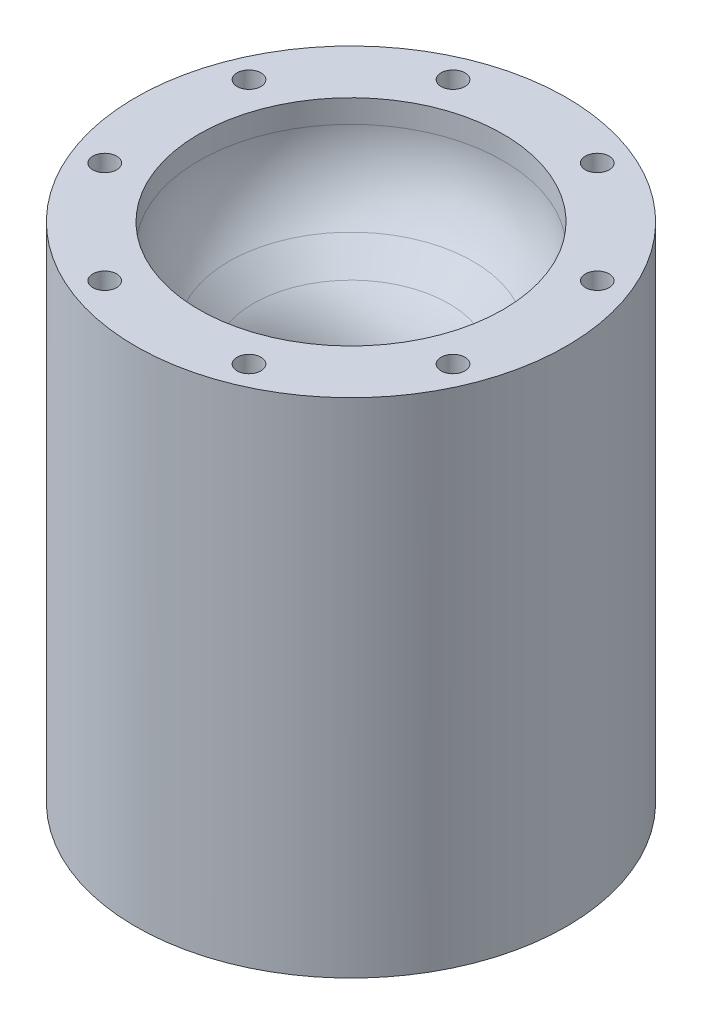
ISO-10303-21;
HEADER;
FILE_DESCRIPTION(('STEP AP214'),'2;1');
FILE_NAME('part.step','',(''),(''),'','','');
FILE_SCHEMA(('AUTOMOTIVE_DESIGN { 1 0 10303 214 1 1 1 1 }'));
ENDSEC;
DATA;
#1=APPLICATION_CONTEXT('core data for automotive mechanical design processes');
#2=APPLICATION_PROTOCOL_DEFINITION('international standard','automotive_design',2000,#1);
#3=PRODUCT_CONTEXT('',#1,'mechanical');
#4=PRODUCT('Part','Part','',(#3));
#5=PRODUCT_RELATED_PRODUCT_CATEGORY('part','',(#4));
#6=PRODUCT_DEFINITION_FORMATION('','',#4);
#7=PRODUCT_DEFINITION_CONTEXT('part definition',#1,'design');
#8=PRODUCT_DEFINITION('design','',#6,#7);
#9=PRODUCT_DEFINITION_SHAPE('','',#8);
#10=(LENGTH_UNIT() NAMED_UNIT(*) SI_UNIT(.MILLI.,.METRE.));
#11=(NAMED_UNIT(*) PLANE_ANGLE_UNIT() SI_UNIT($,.RADIAN.));
#12=(NAMED_UNIT(*) SI_UNIT($,.STERADIAN.) SOLID_ANGLE_UNIT());
#13=UNCERTAINTY_MEASURE_WITH_UNIT(LENGTH_MEASURE(1.E-05),#10,'distance_accuracy_value','');
#14=(GEOMETRIC_REPRESENTATION_CONTEXT(3) GLOBAL_UNCERTAINTY_ASSIGNED_CONTEXT((#13)) GLOBAL_UNIT_ASSIGNED_CONTEXT((#10,
#11,#12)) REPRESENTATION_CONTEXT('',''));
#15=CARTESIAN_POINT('',(0.,0.,0.));
#16=DIRECTION('',(0.,0.,1.));
#17=DIRECTION('',(1.,0.,0.));
#18=AXIS2_PLACEMENT_3D('',#15,#16,#17);
#19=CARTESIAN_POINT('',(-105.474898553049,0.,22.1235140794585));
#20=DIRECTION('',(0.,1.,0.));
#21=DIRECTION('',(-0.546944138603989,0.,0.837169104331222));
#22=AXIS2_PLACEMENT_3D('',#19,#20,#21);
#23=PLANE('',#22);
#24=CARTESIAN_POINT('',(25.5154178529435,0.,61.5996678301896));
#25=DIRECTION('',(0.,1.,0.));
#26=DIRECTION('',(0.,0.,1.));
#27=AXIS2_PLACEMENT_3D('',#24,#25,#26);
#28=CIRCLE('',#27,4.21639999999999);
#29=CARTESIAN_POINT('',(25.5154178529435,0.,65.8160678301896));
#30=VERTEX_POINT('',#29);
#31=EDGE_CURVE('E84',#30,#30,#28,.T.);
#32=ORIENTED_EDGE('',*,*,#31,.F.);
#33=EDGE_LOOP('',(#32));
#34=FACE_BOUND('',#33,.T.);
#35=CARTESIAN_POINT('',(-25.5154178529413,0.,61.5996678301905));
#36=DIRECTION('',(0.,1.,0.));
#37=DIRECTION('',(0.,0.,1.));
#38=AXIS2_PLACEMENT_3D('',#35,#36,#37);
#39=CIRCLE('',#38,4.21639999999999);
#40=CARTESIAN_POINT('',(-25.5154178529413,0.,65.8160678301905));
#41=VERTEX_POINT('',#40);
#42=EDGE_CURVE('E83',#41,#41,#39,.T.);
#43=ORIENTED_EDGE('',*,*,#42,.F.);
#44=EDGE_LOOP('',(#43));
#45=FACE_BOUND('',#44,.T.);
#46=CARTESIAN_POINT('',(-61.5996678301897,0.,25.5154178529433));
#47=DIRECTION('',(0.,1.,0.));
#48=DIRECTION('',(0.,0.,1.));
#49=AXIS2_PLACEMENT_3D('',#46,#47,#48);
#50=CIRCLE('',#49,4.21639999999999);
#51=CARTESIAN_POINT('',(-61.5996678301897,0.,29.7318178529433));
#52=VERTEX_POINT('',#51);
#53=EDGE_CURVE('E94',#52,#52,#50,.T.);
#54=ORIENTED_EDGE('',*,*,#53,.F.);
#55=EDGE_LOOP('',(#54));
#56=FACE_BOUND('',#55,.T.);
#57=CARTESIAN_POINT('',(-61.5996678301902,0.,-25.515417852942));
#58=DIRECTION('',(0.,1.,0.));
#59=DIRECTION('',(0.,0.,1.));
#60=AXIS2_PLACEMENT_3D('',#57,#58,#59);
#61=CIRCLE('',#60,4.21639999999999);
#62=CARTESIAN_POINT('',(-61.5996678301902,0.,-21.299017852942));
#63=VERTEX_POINT('',#62);
#64=EDGE_CURVE('E100',#63,#63,#61,.T.);
#65=ORIENTED_EDGE('',*,*,#64,.F.);
#66=EDGE_LOOP('',(#65));
#67=FACE_BOUND('',#66,.T.);
#68=CARTESIAN_POINT('',(-25.5154178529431,0.,-61.5996678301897));
#69=DIRECTION('',(0.,1.,0.));
#70=DIRECTION('',(0.,0.,1.));
#71=AXIS2_PLACEMENT_3D('',#68,#69,#70);
#72=CIRCLE('',#71,4.21639999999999);
#73=CARTESIAN_POINT('',(-25.5154178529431,0.,-57.3832678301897));
#74=VERTEX_POINT('',#73);
#75=EDGE_CURVE('E106',#74,#74,#72,.T.);
#76=ORIENTED_EDGE('',*,*,#75,.F.);
#77=EDGE_LOOP('',(#76));
#78=FACE_BOUND('',#77,.T.);
#79=CARTESIAN_POINT('',(25.5154178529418,0.,-61.5996678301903));
#80=DIRECTION('',(0.,1.,0.));
#81=DIRECTION('',(0.,0.,1.));
#82=AXIS2_PLACEMENT_3D('',#79,#80,#81);
#83=CIRCLE('',#82,4.21639999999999);
#84=CARTESIAN_POINT('',(25.5154178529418,0.,-57.3832678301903));
#85=VERTEX_POINT('',#84);
#86=EDGE_CURVE('E112',#85,#85,#83,.T.);
#87=ORIENTED_EDGE('',*,*,#86,.F.);
#88=EDGE_LOOP('',(#87));
#89=FACE_BOUND('',#88,.T.);
#90=CARTESIAN_POINT('',(61.5996678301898,0.,-25.5154178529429));
#91=DIRECTION('',(0.,1.,0.));
#92=DIRECTION('',(0.,0.,1.));
#93=AXIS2_PLACEMENT_3D('',#90,#91,#92);
#94=CIRCLE('',#93,4.21639999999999);
#95=CARTESIAN_POINT('',(61.5996678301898,0.,-21.2990178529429));
#96=VERTEX_POINT('',#95);
#97=EDGE_CURVE('E118',#96,#96,#94,.T.);
#98=ORIENTED_EDGE('',*,*,#97,.F.);
#99=EDGE_LOOP('',(#98));
#100=FACE_BOUND('',#99,.T.);
#101=CARTESIAN_POINT('',(61.5996678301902,0.,25.515417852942));
#102=DIRECTION('',(0.,1.,0.));
#103=DIRECTION('',(0.,0.,1.));
#104=AXIS2_PLACEMENT_3D('',#101,#102,#103);
#105=CIRCLE('',#104,4.21639999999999);
#106=CARTESIAN_POINT('',(61.5996678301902,0.,29.731817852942));
#107=VERTEX_POINT('',#106);
#108=EDGE_CURVE('E124',#107,#107,#105,.T.);
#109=ORIENTED_EDGE('',*,*,#108,.F.);
#110=EDGE_LOOP('',(#109));
#111=FACE_BOUND('',#110,.T.);
#112=CARTESIAN_POINT('',(0.,0.,0.));
#113=DIRECTION('',(0.,1.,0.));
#114=DIRECTION('',(-0.546944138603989,0.,0.837169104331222));
#115=AXIS2_PLACEMENT_3D('',#112,#113,#114);
#116=CIRCLE('',#115,53.7924602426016);
#117=CARTESIAN_POINT('',(-29.421470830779,0.,45.0333857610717));
#118=VERTEX_POINT('',#117);
#119=EDGE_CURVE('E134',#118,#118,#116,.F.);
#120=ORIENTED_EDGE('',*,*,#119,.T.);
#121=EDGE_LOOP('',(#120));
#122=FACE_BOUND('',#121,.T.);
#123=CARTESIAN_POINT('',(0.,0.,0.));
#124=DIRECTION('',(0.,1.,0.));
#125=DIRECTION('',(-0.546944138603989,0.,0.837169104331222));
#126=AXIS2_PLACEMENT_3D('',#123,#124,#125);
#127=CIRCLE('',#126,76.2);
#128=CARTESIAN_POINT('',(-41.6771433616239,0.,63.7922857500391));
#129=VERTEX_POINT('',#128);
#130=EDGE_CURVE('E42',#129,#129,#127,.T.);
#131=ORIENTED_EDGE('',*,*,#130,.T.);
#132=EDGE_LOOP('',(#131));
#133=FACE_BOUND('',#132,.T.);
#134=ADVANCED_FACE('F38',(#34,#45,#56,#67,#78,#89,#100,#111,#122,#133),#23,.T.);
#135=CARTESIAN_POINT('',(0.,-67.8726529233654,0.));
#136=DIRECTION('',(0.,-1.,0.));
#137=DIRECTION('',(0.546944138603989,0.,-0.837169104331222));
#138=AXIS2_PLACEMENT_3D('',#135,#136,#137);
#139=CYLINDRICAL_SURFACE('',#138,53.7924602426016);
#140=CARTESIAN_POINT('',(0.,-8.14497921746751,0.));
#141=DIRECTION('',(0.,-1.,0.));
#142=DIRECTION('',(0.546944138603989,0.,-0.837169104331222));
#143=AXIS2_PLACEMENT_3D('',#140,#141,#142);
#144=CIRCLE('',#143,53.7924602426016);
#145=CARTESIAN_POINT('',(29.421470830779,-8.14497921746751,-45.0333857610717));
#146=VERTEX_POINT('',#145);
#147=EDGE_CURVE('E140',#146,#146,#144,.T.);
#148=ORIENTED_EDGE('',*,*,#147,.T.);
#149=EDGE_LOOP('',(#148));
#150=FACE_BOUND('',#149,.T.);
#151=ORIENTED_EDGE('',*,*,#119,.F.);
#152=EDGE_LOOP('',(#151));
#153=FACE_BOUND('',#152,.T.);
#154=ADVANCED_FACE('F40',(#150,#153),#139,.F.);
#155=CARTESIAN_POINT('',(0.,-67.8726529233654,0.));
#156=DIRECTION('',(0.,-1.,0.));
#157=DIRECTION('',(0.546944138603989,0.,-0.837169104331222));
#158=AXIS2_PLACEMENT_3D('',#155,#156,#157);
#159=CYLINDRICAL_SURFACE('',#158,76.2);
#160=CARTESIAN_POINT('',(0.,-177.8,0.));
#161=DIRECTION('',(0.,-1.,0.));
#162=DIRECTION('',(0.546944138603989,0.,-0.837169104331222));
#163=AXIS2_PLACEMENT_3D('',#160,#161,#162);
#164=CIRCLE('',#163,76.2);
#165=CARTESIAN_POINT('',(41.6771433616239,-177.8,-63.7922857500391));
#166=VERTEX_POINT('',#165);
#167=EDGE_CURVE('E143',#166,#166,#164,.T.);
#168=ORIENTED_EDGE('',*,*,#167,.F.);
#169=EDGE_LOOP('',(#168));
#170=FACE_BOUND('',#169,.T.);
#171=ORIENTED_EDGE('',*,*,#130,.F.);
#172=EDGE_LOOP('',(#171));
#173=FACE_BOUND('',#172,.T.);
#174=ADVANCED_FACE('F170',(#170,#173),#159,.T.);
#175=CARTESIAN_POINT('',(22.3576150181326,-74.3818925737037,14.6068057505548));
#176=CARTESIAN_POINT('',(22.3151212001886,-74.3311317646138,14.5790434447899));
#177=CARTESIAN_POINT('',(22.2531052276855,-74.2547747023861,14.5385268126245));
#178=CARTESIAN_POINT('',(22.1142299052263,-74.081294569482,14.4477959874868));
#179=CARTESIAN_POINT('',(21.9985251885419,-73.9226045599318,14.372203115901));
#180=CARTESIAN_POINT('',(21.8415816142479,-73.7055665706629,14.2696678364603));
#181=CARTESIAN_POINT('',(21.6955199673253,-73.4833804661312,14.1742420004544));
#182=CARTESIAN_POINT('',(21.5175234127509,-73.198171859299,14.0579522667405));
#183=CARTESIAN_POINT('',(21.3590694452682,-72.9183567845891,13.9544302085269));
#184=CARTESIAN_POINT('',(21.2033340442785,-72.6239544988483,13.8526842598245));
#185=CARTESIAN_POINT('',(21.0606165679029,-72.327436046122,13.7594432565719));
#186=CARTESIAN_POINT('',(20.9250437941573,-72.0219351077,13.6708700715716));
#187=CARTESIAN_POINT('',(20.8004861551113,-71.7123196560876,13.5894933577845));
#188=CARTESIAN_POINT('',(20.6848821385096,-71.3962800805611,13.5139662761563));
#189=CARTESIAN_POINT('',(20.5797523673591,-71.0759999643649,13.4452822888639));
#190=CARTESIAN_POINT('',(20.484417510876,-70.7507455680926,13.3829975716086));
#191=CARTESIAN_POINT('',(20.3995136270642,-70.4218923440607,13.3275276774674));
#192=CARTESIAN_POINT('',(20.3248532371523,-70.0890073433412,13.2787501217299));
#193=CARTESIAN_POINT('',(20.2607278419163,-69.7536497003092,13.2368553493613));
#194=CARTESIAN_POINT('',(20.2071118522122,-69.414703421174,13.2018266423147));
#195=CARTESIAN_POINT('',(20.1641528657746,-69.075190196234,13.1737604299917));
#196=CARTESIAN_POINT('',(20.1358987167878,-68.7740862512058,13.1553012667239));
#197=CARTESIAN_POINT('',(20.1184006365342,-68.519417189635,13.1438693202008));
#198=CARTESIAN_POINT('',(20.1082943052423,-68.2997170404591,13.1372665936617));
#199=CARTESIAN_POINT('',(20.10290474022,-68.1402939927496,13.133745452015));
#200=CARTESIAN_POINT('',(20.1008809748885,-67.9827666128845,13.1324232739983));
#201=CARTESIAN_POINT('',(20.1004307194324,-67.9085455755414,13.1321291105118));
#202=CARTESIAN_POINT('',(20.1004301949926,-67.8726529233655,13.1321287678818));
#203=B_SPLINE_CURVE_WITH_KNOTS('',4,(#175,#176,#177,#178,#179,#180,#181,#182,#183,#184,#185,
#186,#187,#188,#189,#190,#191,#192,#193,#194,#195,#196,#197,#198,#199,#200,#201,#202),
.UNSPECIFIED.,.F.,.F.,(5,1,1,1,1,1,1,1,1,1,1,1,1,1,1,1,1,1,1,1,1,1,1,1,5),(0.0825688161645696,
0.122284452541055,0.142142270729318,0.162000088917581,0.201715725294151,0.241431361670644,
0.281146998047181,0.320862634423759,0.360578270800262,0.400293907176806,0.440009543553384,
0.479725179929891,0.519440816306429,0.55915645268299,0.598872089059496,0.638587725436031,
0.678303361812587,0.718018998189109,0.75773463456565,0.797450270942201,0.837165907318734,
0.857023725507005,0.876881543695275,0.896739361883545,0.916597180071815),.UNSPECIFIED.);
#204=CARTESIAN_POINT('',(0.,-67.8726529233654,0.));
#205=DIRECTION('',(0.,-1.,0.));
#206=AXIS1_PLACEMENT('',#204,#205);
#207=SURFACE_OF_REVOLUTION('',#203,#206);
#208=CARTESIAN_POINT('',(0.,-67.8726529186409,0.));
#209=DIRECTION('',(0.,-1.,0.));
#210=DIRECTION('',(0.546944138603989,0.,-0.837169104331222));
#211=AXIS2_PLACEMENT_3D('',#208,#209,#210);
#212=CIRCLE('',#211,24.0100000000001);
#213=CARTESIAN_POINT('',(13.1321287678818,-67.8726529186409,-20.1004301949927));
#214=VERTEX_POINT('',#213);
#215=EDGE_CURVE('E130',#214,#214,#212,.T.);
#216=ORIENTED_EDGE('',*,*,#215,.F.);
#217=EDGE_LOOP('',(#216));
#218=FACE_BOUND('',#217,.T.);
#219=CARTESIAN_POINT('',(0.,-74.3818925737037,0.));
#220=DIRECTION('',(0.,-1.,0.));
#221=DIRECTION('',(0.546944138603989,0.,-0.837169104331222));
#222=AXIS2_PLACEMENT_3D('',#219,#220,#221);
#223=CIRCLE('',#222,26.7062113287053);
#224=CARTESIAN_POINT('',(14.6068057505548,-74.3818925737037,-22.3576150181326));
#225=VERTEX_POINT('',#224);
#226=EDGE_CURVE('E11',#225,#225,#223,.T.);
#227=ORIENTED_EDGE('',*,*,#226,.T.);
#228=EDGE_LOOP('',(#227));
#229=FACE_BOUND('',#228,.T.);
#230=ADVANCED_FACE('F172',(#218,#229),#207,.T.);
#231=CARTESIAN_POINT('',(20.1004301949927,-67.8726529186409,13.1321287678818));
#232=CARTESIAN_POINT('',(20.1004312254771,-67.8021242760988,13.1321294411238));
#233=CARTESIAN_POINT('',(20.1008742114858,-67.6590687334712,13.1324188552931));
#234=CARTESIAN_POINT('',(20.1028630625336,-67.3294700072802,13.133718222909));
#235=CARTESIAN_POINT('',(20.1081576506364,-67.0484925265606,13.1371773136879));
#236=CARTESIAN_POINT('',(20.1160983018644,-66.6778308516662,13.1423651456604));
#237=CARTESIAN_POINT('',(20.1266820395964,-66.3592178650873,13.1492797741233));
#238=CARTESIAN_POINT('',(20.1399094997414,-66.0107133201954,13.1579216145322));
#239=CARTESIAN_POINT('',(20.1557782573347,-65.6789460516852,13.1682890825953));
#240=CARTESIAN_POINT('',(20.178915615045,-65.254583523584,13.1834053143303));
#241=CARTESIAN_POINT('',(20.2119571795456,-64.750618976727,13.2049922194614));
#242=CARTESIAN_POINT('',(20.2714067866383,-63.9926742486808,13.243832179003));
#243=CARTESIAN_POINT('',(20.3717222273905,-62.9862025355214,13.3093708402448));
#244=CARTESIAN_POINT('',(20.5193648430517,-61.8159421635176,13.4058295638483));
#245=CARTESIAN_POINT('',(20.7298284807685,-60.4874865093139,13.5433308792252));
#246=CARTESIAN_POINT('',(20.9817411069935,-59.1690784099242,13.7079118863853));
#247=CARTESIAN_POINT('',(21.2747296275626,-57.8630157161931,13.8993288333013));
#248=CARTESIAN_POINT('',(21.6084171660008,-56.5708333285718,14.1173354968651));
#249=CARTESIAN_POINT('',(21.9822838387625,-55.2945535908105,14.3615922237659));
#250=CARTESIAN_POINT('',(22.3958938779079,-54.0357654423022,14.6318143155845));
#251=CARTESIAN_POINT('',(22.8485259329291,-52.7964557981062,14.9275304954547));
#252=CARTESIAN_POINT('',(23.3397820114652,-51.5780431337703,15.2484807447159));
#253=CARTESIAN_POINT('',(23.8685882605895,-50.3827141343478,15.5939634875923));
#254=CARTESIAN_POINT('',(24.4348435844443,-49.2113651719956,15.963912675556));
#255=CARTESIAN_POINT('',(25.0366950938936,-48.0669095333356,16.3571177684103));
#256=CARTESIAN_POINT('',(25.675100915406,-46.9487928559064,16.7742047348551));
#257=CARTESIAN_POINT('',(26.2620780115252,-45.9982411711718,17.1576919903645));
#258=CARTESIAN_POINT('',(26.7891336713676,-45.1992074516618,17.5020310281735));
#259=CARTESIAN_POINT('',(27.2373475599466,-44.5522307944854,17.7948607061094));
#260=CARTESIAN_POINT('',(27.6125059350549,-44.032647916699,18.0399613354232));
#261=CARTESIAN_POINT('',(27.9776742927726,-43.5428366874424,18.2785352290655));
#262=CARTESIAN_POINT('',(28.3354603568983,-43.084168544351,18.5122860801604));
#263=CARTESIAN_POINT('',(28.5947588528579,-42.7587846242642,18.6816924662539));
#264=CARTESIAN_POINT('',(28.8386273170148,-42.4630038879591,18.8410180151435));
#265=CARTESIAN_POINT('',(28.9219695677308,-42.3627030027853,18.8954676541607));
#266=CARTESIAN_POINT('',(28.9637195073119,-42.312830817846,18.9227439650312));
#267=B_SPLINE_CURVE_WITH_KNOTS('',4,(#231,#232,#233,#234,#235,#236,#237,#238,#239,#240,#241,
#242,#243,#244,#245,#246,#247,#248,#249,#250,#251,#252,#253,#254,#255,#256,#257,#258,#259,#260,
#261,#262,#263,#264,#265,#266),.UNSPECIFIED.,.F.,.F.,(5,1,1,1,1,1,1,1,1,1,1,1,1,1,1,1,1,1,1,1,1,
1,1,1,1,1,1,1,1,1,1,1,5),(0.0826377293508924,0.0925749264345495,0.10251212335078,
0.11244932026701,0.122386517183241,0.132323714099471,0.142260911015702,0.152198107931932,
0.162135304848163,0.182009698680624,0.201884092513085,0.241632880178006,0.281381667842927,
0.321130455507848,0.360879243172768,0.400628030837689,0.44037681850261,0.480125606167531,
0.519874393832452,0.559623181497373,0.599371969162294,0.639120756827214,0.678869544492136,
0.718618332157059,0.758367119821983,0.798115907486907,0.817990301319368,0.837864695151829,
0.857739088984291,0.877613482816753,0.897487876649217,0.907425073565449,0.917362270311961),.UNSPECIFIED.);
#268=CARTESIAN_POINT('',(0.,-67.8726529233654,0.));
#269=DIRECTION('',(0.,-1.,0.));
#270=AXIS1_PLACEMENT('',#268,#269);
#271=SURFACE_OF_REVOLUTION('',#267,#270);
#272=CARTESIAN_POINT('',(0.,-42.3128308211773,0.));
#273=DIRECTION('',(0.,-1.,0.));
#274=DIRECTION('',(0.546944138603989,0.,-0.837169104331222));
#275=AXIS2_PLACEMENT_3D('',#272,#273,#274);
#276=CIRCLE('',#275,34.5972150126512);
#277=CARTESIAN_POINT('',(18.9227439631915,-42.3128308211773,-28.9637195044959));
#278=VERTEX_POINT('',#277);
#279=EDGE_CURVE('E133',#278,#278,#276,.T.);
#280=ORIENTED_EDGE('',*,*,#279,.F.);
#281=EDGE_LOOP('',(#280));
#282=FACE_BOUND('',#281,.T.);
#283=ORIENTED_EDGE('',*,*,#215,.T.);
#284=EDGE_LOOP('',(#283));
#285=FACE_BOUND('',#284,.T.);
#286=ADVANCED_FACE('F178',(#282,#285),#271,.T.);
#287=CARTESIAN_POINT('',(0.,-42.3128308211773,0.));
#288=DIRECTION('',(0.,1.,0.));
#289=DIRECTION('',(-0.546944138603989,0.,0.837169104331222));
#290=AXIS2_PLACEMENT_3D('',#287,#288,#289);
#291=CONICAL_SURFACE('',#290,34.5972150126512,0.785398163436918);
#292=CARTESIAN_POINT('',(0.,-33.7052026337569,0.));
#293=DIRECTION('',(0.,-1.,0.));
#294=DIRECTION('',(0.546944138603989,0.,-0.837169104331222));
#295=AXIS2_PLACEMENT_3D('',#292,#293,#294);
#296=CIRCLE('',#295,43.2048432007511);
#297=CARTESIAN_POINT('',(23.6306357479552,-33.7052026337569,-36.1697598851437));
#298=VERTEX_POINT('',#297);
#299=EDGE_CURVE('E137',#298,#298,#296,.T.);
#300=ORIENTED_EDGE('',*,*,#299,.F.);
#301=EDGE_LOOP('',(#300));
#302=FACE_BOUND('',#301,.T.);
#303=ORIENTED_EDGE('',*,*,#279,.T.);
#304=EDGE_LOOP('',(#303));
#305=FACE_BOUND('',#304,.T.);
#306=ADVANCED_FACE('F205',(#302,#305),#291,.F.);
#307=CARTESIAN_POINT('',(36.1697598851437,-33.7052026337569,23.6306357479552));
#308=CARTESIAN_POINT('',(36.2115113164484,-33.6553302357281,23.6579130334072));
#309=CARTESIAN_POINT('',(36.2957379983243,-33.5539760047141,23.7129404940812));
#310=CARTESIAN_POINT('',(36.4880192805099,-33.3209428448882,23.8385628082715));
#311=CARTESIAN_POINT('',(36.6553293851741,-33.1121521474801,23.947870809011));
#312=CARTESIAN_POINT('',(36.912786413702,-32.7878611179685,24.1160741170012));
#313=CARTESIAN_POINT('',(37.1918305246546,-32.4254996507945,24.2983808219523));
#314=CARTESIAN_POINT('',(37.5269918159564,-31.9782446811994,24.517350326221));
#315=CARTESIAN_POINT('',(37.8934129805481,-31.4691110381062,24.7567427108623));
#316=CARTESIAN_POINT('',(38.3460872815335,-30.8168202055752,25.0524864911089));
#317=CARTESIAN_POINT('',(38.8704323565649,-30.021040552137,25.3950546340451));
#318=CARTESIAN_POINT('',(39.4591573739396,-29.0684161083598,25.7796838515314));
#319=CARTESIAN_POINT('',(40.0965556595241,-27.9515197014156,26.1961125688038));
#320=CARTESIAN_POINT('',(40.6990241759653,-26.8063374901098,26.5897207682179));
#321=CARTESIAN_POINT('',(41.2649463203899,-25.635399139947,26.9594522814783));
#322=CARTESIAN_POINT('',(41.7939875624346,-24.439790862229,27.3050885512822));
#323=CARTESIAN_POINT('',(42.2851319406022,-23.2215235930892,27.6259658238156));
#324=CARTESIAN_POINT('',(42.7378617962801,-21.9820839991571,27.9217458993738));
#325=CARTESIAN_POINT('',(43.1514379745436,-20.7233573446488,28.1919458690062));
#326=CARTESIAN_POINT('',(43.4786128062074,-19.6065231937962,28.4056976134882));
#327=CARTESIAN_POINT('',(43.7338996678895,-18.6394146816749,28.5724830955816));
#328=CARTESIAN_POINT('',(43.9689138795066,-17.6650033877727,28.7260239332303));
#329=CARTESIAN_POINT('',(44.1835313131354,-16.6839533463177,28.8662390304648));
#330=CARTESIAN_POINT('',(44.3724712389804,-15.6950496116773,28.9896783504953));
#331=CARTESIAN_POINT('',(44.5355071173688,-14.700067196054,29.0961938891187));
#332=CARTESIAN_POINT('',(44.6777128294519,-13.7000570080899,29.1891005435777));
#333=CARTESIAN_POINT('',(44.7788019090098,-12.8643265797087,29.2551446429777));
#334=CARTESIAN_POINT('',(44.8624029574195,-12.024012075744,29.309763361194));
#335=CARTESIAN_POINT('',(44.9284595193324,-11.1844942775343,29.3529198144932));
#336=CARTESIAN_POINT('',(44.9654725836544,-10.5915325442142,29.3771014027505));
#337=CARTESIAN_POINT('',(44.9905979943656,-10.0908980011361,29.3935164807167));
#338=CARTESIAN_POINT('',(45.0071327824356,-9.65965482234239,29.4043190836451));
#339=CARTESIAN_POINT('',(45.0177170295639,-9.33992495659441,29.4112340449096));
#340=CARTESIAN_POINT('',(45.0256579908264,-8.967696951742,29.4164220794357));
#341=CARTESIAN_POINT('',(45.0309527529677,-8.69092782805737,29.4198812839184));
#342=CARTESIAN_POINT('',(45.0329417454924,-8.35708634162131,29.4211807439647));
#343=CARTESIAN_POINT('',(45.0333847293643,-8.2155092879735,29.4214701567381));
#344=CARTESIAN_POINT('',(45.0333857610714,-8.1449792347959,29.4214708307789));
#345=B_SPLINE_CURVE_WITH_KNOTS('',4,(#307,#308,#309,#310,#311,#312,#313,#314,#315,#316,#317,
#318,#319,#320,#321,#322,#323,#324,#325,#326,#327,#328,#329,#330,#331,#332,#333,#334,#335,#336,
#337,#338,#339,#340,#341,#342,#343,#344),.UNSPECIFIED.,.F.,.F.,(5,1,1,1,1,1,1,1,1,1,1,1,1,1,1,1,
1,1,1,1,1,1,1,1,1,1,1,1,1,1,1,1,1,1,5),(0.0826377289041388,0.0925749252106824,0.102512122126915,
0.112449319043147,0.122386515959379,0.14226090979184,0.162135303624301,0.182009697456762,
0.201884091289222,0.241632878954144,0.281381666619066,0.321130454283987,0.360879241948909,
0.400628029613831,0.440376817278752,0.480125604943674,0.519874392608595,0.559623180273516,
0.599371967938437,0.619246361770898,0.639120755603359,0.678869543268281,0.718618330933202,
0.738492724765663,0.758367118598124,0.798115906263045,0.817990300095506,0.837864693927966,
0.857739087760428,0.867676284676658,0.877613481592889,0.887550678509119,0.897487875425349,
0.90742507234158,0.917362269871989),.UNSPECIFIED.);
#346=CARTESIAN_POINT('',(0.,-67.8726529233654,0.));
#347=DIRECTION('',(0.,-1.,0.));
#348=AXIS1_PLACEMENT('',#346,#347);
#349=SURFACE_OF_REVOLUTION('',#345,#348);
#350=ORIENTED_EDGE('',*,*,#147,.F.);
#351=EDGE_LOOP('',(#350));
#352=FACE_BOUND('',#351,.T.);
#353=ORIENTED_EDGE('',*,*,#299,.T.);
#354=EDGE_LOOP('',(#353));
#355=FACE_BOUND('',#354,.T.);
#356=ADVANCED_FACE('F208',(#352,#355),#349,.T.);
#357=CARTESIAN_POINT('',(59.9735016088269,-177.8,39.1822333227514));
#358=DIRECTION('',(0.,1.,0.));
#359=DIRECTION('',(-0.546944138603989,0.,0.837169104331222));
#360=AXIS2_PLACEMENT_3D('',#357,#358,#359);
#361=PLANE('',#360);
#362=CARTESIAN_POINT('',(0.,-177.8,0.));
#363=DIRECTION('',(0.,-1.,0.));
#364=DIRECTION('',(0.546944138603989,0.,-0.837169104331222));
#365=AXIS2_PLACEMENT_3D('',#362,#363,#364);
#366=CIRCLE('',#365,71.6384554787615);
#367=CARTESIAN_POINT('',(39.1822333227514,-177.8,-59.9735016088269));
#368=VERTEX_POINT('',#367);
#369=EDGE_CURVE('E47',#368,#368,#366,.T.);
#370=ORIENTED_EDGE('',*,*,#369,.F.);
#371=EDGE_LOOP('',(#370));
#372=FACE_BOUND('',#371,.T.);
#373=ORIENTED_EDGE('',*,*,#167,.T.);
#374=EDGE_LOOP('',(#373));
#375=FACE_BOUND('',#374,.T.);
#376=ADVANCED_FACE('F165',(#372,#375),#361,.F.);
#377=CARTESIAN_POINT('',(59.9735016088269,-177.8,39.1822333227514));
#378=CARTESIAN_POINT('',(41.1655583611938,-102.508607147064,26.8945195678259));
#379=CARTESIAN_POINT('',(22.3576150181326,-74.3818925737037,14.6068057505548));
#380=B_SPLINE_CURVE_WITH_KNOTS('',2,(#377,#378,#379),.UNSPECIFIED.,.F.,.F.,(3,3),(0.,1.),.UNSPECIFIED.);
#381=CARTESIAN_POINT('',(0.,-67.8726529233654,0.));
#382=DIRECTION('',(0.,-1.,0.));
#383=AXIS1_PLACEMENT('',#381,#382);
#384=SURFACE_OF_REVOLUTION('',#380,#383);
#385=ORIENTED_EDGE('',*,*,#226,.F.);
#386=EDGE_LOOP('',(#385));
#387=FACE_BOUND('',#386,.T.);
#388=ORIENTED_EDGE('',*,*,#369,.T.);
#389=EDGE_LOOP('',(#388));
#390=FACE_BOUND('',#389,.T.);
#391=ADVANCED_FACE('F160',(#387,#390),#384,.T.);
#392=CARTESIAN_POINT('',(61.5996678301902,-22.22754,25.515417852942));
#393=DIRECTION('',(0.,1.,0.));
#394=DIRECTION('',(0.,0.,1.));
#395=AXIS2_PLACEMENT_3D('',#392,#393,#394);
#396=CONICAL_SURFACE('',#395,4.21639999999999,1.02974425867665);
#397=CARTESIAN_POINT('',(61.5996678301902,-24.7610087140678,25.515417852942));
#398=VERTEX_POINT('',#397);
#399=VERTEX_LOOP('',#398);
#400=FACE_BOUND('',#399,.T.);
#401=CARTESIAN_POINT('',(61.5996678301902,-22.22754,25.515417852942));
#402=DIRECTION('',(0.,1.,0.));
#403=DIRECTION('',(0.,0.,1.));
#404=AXIS2_PLACEMENT_3D('',#401,#402,#403);
#405=CIRCLE('',#404,4.21639999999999);
#406=CARTESIAN_POINT('',(61.5996678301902,-22.22754,29.731817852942));
#407=VERTEX_POINT('',#406);
#408=EDGE_CURVE('E127',#407,#407,#405,.T.);
#409=ORIENTED_EDGE('',*,*,#408,.T.);
#410=EDGE_LOOP('',(#409));
#411=FACE_BOUND('',#410,.T.);
#412=ADVANCED_FACE('F164',(#400,#411),#396,.F.);
#413=CARTESIAN_POINT('',(61.5996678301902,0.,25.515417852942));
#414=DIRECTION('',(0.,1.,0.));
#415=DIRECTION('',(0.,0.,1.));
#416=AXIS2_PLACEMENT_3D('',#413,#414,#415);
#417=CYLINDRICAL_SURFACE('',#416,4.21639999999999);
#418=ORIENTED_EDGE('',*,*,#408,.F.);
#419=EDGE_LOOP('',(#418));
#420=FACE_BOUND('',#419,.T.);
#421=ORIENTED_EDGE('',*,*,#108,.T.);
#422=EDGE_LOOP('',(#421));
#423=FACE_BOUND('',#422,.T.);
#424=ADVANCED_FACE('F241',(#420,#423),#417,.F.);
#425=CARTESIAN_POINT('',(61.5996678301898,-22.22754,-25.5154178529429));
#426=DIRECTION('',(0.,1.,0.));
#427=DIRECTION('',(0.,0.,1.));
#428=AXIS2_PLACEMENT_3D('',#425,#426,#427);
#429=CONICAL_SURFACE('',#428,4.21639999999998,1.02974425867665);
#430=CARTESIAN_POINT('',(61.5996678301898,-24.7610087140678,-25.5154178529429));
#431=VERTEX_POINT('',#430);
#432=VERTEX_LOOP('',#431);
#433=FACE_BOUND('',#432,.T.);
#434=CARTESIAN_POINT('',(61.5996678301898,-22.22754,-25.5154178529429));
#435=DIRECTION('',(0.,1.,0.));
#436=DIRECTION('',(0.,0.,1.));
#437=AXIS2_PLACEMENT_3D('',#434,#435,#436);
#438=CIRCLE('',#437,4.21639999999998);
#439=CARTESIAN_POINT('',(61.5996678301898,-22.22754,-21.2990178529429));
#440=VERTEX_POINT('',#439);
#441=EDGE_CURVE('E121',#440,#440,#438,.T.);
#442=ORIENTED_EDGE('',*,*,#441,.T.);
#443=EDGE_LOOP('',(#442));
#444=FACE_BOUND('',#443,.T.);
#445=ADVANCED_FACE('F248',(#433,#444),#429,.F.);
#446=CARTESIAN_POINT('',(61.5996678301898,0.,-25.5154178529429));
#447=DIRECTION('',(0.,1.,0.));
#448=DIRECTION('',(0.,0.,1.));
#449=AXIS2_PLACEMENT_3D('',#446,#447,#448);
#450=CYLINDRICAL_SURFACE('',#449,4.21639999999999);
#451=ORIENTED_EDGE('',*,*,#441,.F.);
#452=EDGE_LOOP('',(#451));
#453=FACE_BOUND('',#452,.T.);
#454=ORIENTED_EDGE('',*,*,#97,.T.);
#455=EDGE_LOOP('',(#454));
#456=FACE_BOUND('',#455,.T.);
#457=ADVANCED_FACE('F256',(#453,#456),#450,.F.);
#458=CARTESIAN_POINT('',(25.5154178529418,-22.22754,-61.5996678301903));
#459=DIRECTION('',(0.,1.,0.));
#460=DIRECTION('',(0.,0.,1.));
#461=AXIS2_PLACEMENT_3D('',#458,#459,#460);
#462=CONICAL_SURFACE('',#461,4.21639999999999,1.02974425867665);
#463=CARTESIAN_POINT('',(25.5154178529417,-24.7610087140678,-61.5996678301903));
#464=VERTEX_POINT('',#463);
#465=VERTEX_LOOP('',#464);
#466=FACE_BOUND('',#465,.T.);
#467=CARTESIAN_POINT('',(25.5154178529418,-22.22754,-61.5996678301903));
#468=DIRECTION('',(0.,1.,0.));
#469=DIRECTION('',(0.,0.,1.));
#470=AXIS2_PLACEMENT_3D('',#467,#468,#469);
#471=CIRCLE('',#470,4.21639999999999);
#472=CARTESIAN_POINT('',(25.5154178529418,-22.22754,-57.3832678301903));
#473=VERTEX_POINT('',#472);
#474=EDGE_CURVE('E115',#473,#473,#471,.T.);
#475=ORIENTED_EDGE('',*,*,#474,.T.);
#476=EDGE_LOOP('',(#475));
#477=FACE_BOUND('',#476,.T.);
#478=ADVANCED_FACE('F265',(#466,#477),#462,.F.);
#479=CARTESIAN_POINT('',(25.5154178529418,0.,-61.5996678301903));
#480=DIRECTION('',(0.,1.,0.));
#481=DIRECTION('',(0.,0.,1.));
#482=AXIS2_PLACEMENT_3D('',#479,#480,#481);
#483=CYLINDRICAL_SURFACE('',#482,4.21639999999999);
#484=ORIENTED_EDGE('',*,*,#474,.F.);
#485=EDGE_LOOP('',(#484));
#486=FACE_BOUND('',#485,.T.);
#487=ORIENTED_EDGE('',*,*,#86,.T.);
#488=EDGE_LOOP('',(#487));
#489=FACE_BOUND('',#488,.T.);
#490=ADVANCED_FACE('F274',(#486,#489),#483,.F.);
#491=CARTESIAN_POINT('',(-25.5154178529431,-22.22754,-61.5996678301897));
#492=DIRECTION('',(0.,1.,0.));
#493=DIRECTION('',(0.,0.,1.));
#494=AXIS2_PLACEMENT_3D('',#491,#492,#493);
#495=CONICAL_SURFACE('',#494,4.21639999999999,1.02974425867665);
#496=CARTESIAN_POINT('',(-25.5154178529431,-24.7610087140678,-61.5996678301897));
#497=VERTEX_POINT('',#496);
#498=VERTEX_LOOP('',#497);
#499=FACE_BOUND('',#498,.T.);
#500=CARTESIAN_POINT('',(-25.5154178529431,-22.22754,-61.5996678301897));
#501=DIRECTION('',(0.,1.,0.));
#502=DIRECTION('',(0.,0.,1.));
#503=AXIS2_PLACEMENT_3D('',#500,#501,#502);
#504=CIRCLE('',#503,4.21639999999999);
#505=CARTESIAN_POINT('',(-25.5154178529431,-22.22754,-57.3832678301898));
#506=VERTEX_POINT('',#505);
#507=EDGE_CURVE('E109',#506,#506,#504,.T.);
#508=ORIENTED_EDGE('',*,*,#507,.T.);
#509=EDGE_LOOP('',(#508));
#510=FACE_BOUND('',#509,.T.);
#511=ADVANCED_FACE('F282',(#499,#510),#495,.F.);
#512=CARTESIAN_POINT('',(-25.5154178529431,0.,-61.5996678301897));
#513=DIRECTION('',(0.,1.,0.));
#514=DIRECTION('',(0.,0.,1.));
#515=AXIS2_PLACEMENT_3D('',#512,#513,#514);
#516=CYLINDRICAL_SURFACE('',#515,4.21639999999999);
#517=ORIENTED_EDGE('',*,*,#507,.F.);
#518=EDGE_LOOP('',(#517));
#519=FACE_BOUND('',#518,.T.);
#520=ORIENTED_EDGE('',*,*,#75,.T.);
#521=EDGE_LOOP('',(#520));
#522=FACE_BOUND('',#521,.T.);
#523=ADVANCED_FACE('F290',(#519,#522),#516,.F.);
#524=CARTESIAN_POINT('',(-61.5996678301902,-22.22754,-25.515417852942));
#525=DIRECTION('',(0.,1.,0.));
#526=DIRECTION('',(0.,0.,1.));
#527=AXIS2_PLACEMENT_3D('',#524,#525,#526);
#528=CONICAL_SURFACE('',#527,4.21639999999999,1.02974425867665);
#529=CARTESIAN_POINT('',(-61.5996678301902,-24.7610087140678,-25.515417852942));
#530=VERTEX_POINT('',#529);
#531=VERTEX_LOOP('',#530);
#532=FACE_BOUND('',#531,.T.);
#533=CARTESIAN_POINT('',(-61.5996678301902,-22.22754,-25.515417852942));
#534=DIRECTION('',(0.,1.,0.));
#535=DIRECTION('',(0.,0.,1.));
#536=AXIS2_PLACEMENT_3D('',#533,#534,#535);
#537=CIRCLE('',#536,4.21639999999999);
#538=CARTESIAN_POINT('',(-61.5996678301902,-22.22754,-21.299017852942));
#539=VERTEX_POINT('',#538);
#540=EDGE_CURVE('E103',#539,#539,#537,.T.);
#541=ORIENTED_EDGE('',*,*,#540,.T.);
#542=EDGE_LOOP('',(#541));
#543=FACE_BOUND('',#542,.T.);
#544=ADVANCED_FACE('F298',(#532,#543),#528,.F.);
#545=CARTESIAN_POINT('',(-61.5996678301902,0.,-25.515417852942));
#546=DIRECTION('',(0.,1.,0.));
#547=DIRECTION('',(0.,0.,1.));
#548=AXIS2_PLACEMENT_3D('',#545,#546,#547);
#549=CYLINDRICAL_SURFACE('',#548,4.21639999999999);
#550=ORIENTED_EDGE('',*,*,#540,.F.);
#551=EDGE_LOOP('',(#550));
#552=FACE_BOUND('',#551,.T.);
#553=ORIENTED_EDGE('',*,*,#64,.T.);
#554=EDGE_LOOP('',(#553));
#555=FACE_BOUND('',#554,.T.);
#556=ADVANCED_FACE('F307',(#552,#555),#549,.F.);
#557=CARTESIAN_POINT('',(-61.5996678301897,-22.22754,25.5154178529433));
#558=DIRECTION('',(0.,1.,0.));
#559=DIRECTION('',(0.,0.,1.));
#560=AXIS2_PLACEMENT_3D('',#557,#558,#559);
#561=CONICAL_SURFACE('',#560,4.21639999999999,1.02974425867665);
#562=CARTESIAN_POINT('',(-61.5996678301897,-24.7610087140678,25.5154178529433));
#563=VERTEX_POINT('',#562);
#564=VERTEX_LOOP('',#563);
#565=FACE_BOUND('',#564,.T.);
#566=CARTESIAN_POINT('',(-61.5996678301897,-22.22754,25.5154178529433));
#567=DIRECTION('',(0.,1.,0.));
#568=DIRECTION('',(0.,0.,1.));
#569=AXIS2_PLACEMENT_3D('',#566,#567,#568);
#570=CIRCLE('',#569,4.21639999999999);
#571=CARTESIAN_POINT('',(-61.5996678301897,-22.22754,29.7318178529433));
#572=VERTEX_POINT('',#571);
#573=EDGE_CURVE('E97',#572,#572,#570,.T.);
#574=ORIENTED_EDGE('',*,*,#573,.T.);
#575=EDGE_LOOP('',(#574));
#576=FACE_BOUND('',#575,.T.);
#577=ADVANCED_FACE('F315',(#565,#576),#561,.F.);
#578=CARTESIAN_POINT('',(-61.5996678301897,0.,25.5154178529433));
#579=DIRECTION('',(0.,1.,0.));
#580=DIRECTION('',(0.,0.,1.));
#581=AXIS2_PLACEMENT_3D('',#578,#579,#580);
#582=CYLINDRICAL_SURFACE('',#581,4.21639999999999);
#583=ORIENTED_EDGE('',*,*,#573,.F.);
#584=EDGE_LOOP('',(#583));
#585=FACE_BOUND('',#584,.T.);
#586=ORIENTED_EDGE('',*,*,#53,.T.);
#587=EDGE_LOOP('',(#586));
#588=FACE_BOUND('',#587,.T.);
#589=ADVANCED_FACE('F324',(#585,#588),#582,.F.);
#590=CARTESIAN_POINT('',(-25.5154178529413,-22.22754,61.5996678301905));
#591=DIRECTION('',(0.,1.,0.));
#592=DIRECTION('',(0.,0.,1.));
#593=AXIS2_PLACEMENT_3D('',#590,#591,#592);
#594=CONICAL_SURFACE('',#593,4.21639999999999,1.02974425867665);
#595=CARTESIAN_POINT('',(-25.5154178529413,-24.7610087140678,61.5996678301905));
#596=VERTEX_POINT('',#595);
#597=VERTEX_LOOP('',#596);
#598=FACE_BOUND('',#597,.T.);
#599=CARTESIAN_POINT('',(-25.5154178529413,-22.22754,61.5996678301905));
#600=DIRECTION('',(0.,1.,0.));
#601=DIRECTION('',(0.,0.,1.));
#602=AXIS2_PLACEMENT_3D('',#599,#600,#601);
#603=CIRCLE('',#602,4.21639999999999);
#604=CARTESIAN_POINT('',(-25.5154178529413,-22.22754,65.8160678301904));
#605=VERTEX_POINT('',#604);
#606=EDGE_CURVE('E87',#605,#605,#603,.T.);
#607=ORIENTED_EDGE('',*,*,#606,.T.);
#608=EDGE_LOOP('',(#607));
#609=FACE_BOUND('',#608,.T.);
#610=ADVANCED_FACE('F332',(#598,#609),#594,.F.);
#611=CARTESIAN_POINT('',(-25.5154178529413,0.,61.5996678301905));
#612=DIRECTION('',(0.,1.,0.));
#613=DIRECTION('',(0.,0.,1.));
#614=AXIS2_PLACEMENT_3D('',#611,#612,#613);
#615=CYLINDRICAL_SURFACE('',#614,4.21639999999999);
#616=ORIENTED_EDGE('',*,*,#606,.F.);
#617=EDGE_LOOP('',(#616));
#618=FACE_BOUND('',#617,.T.);
#619=ORIENTED_EDGE('',*,*,#42,.T.);
#620=EDGE_LOOP('',(#619));
#621=FACE_BOUND('',#620,.T.);
#622=ADVANCED_FACE('F77',(#618,#621),#615,.F.);
#623=CARTESIAN_POINT('',(25.5154178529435,-22.22754,61.5996678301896));
#624=DIRECTION('',(0.,1.,0.));
#625=DIRECTION('',(0.,0.,1.));
#626=AXIS2_PLACEMENT_3D('',#623,#624,#625);
#627=CONICAL_SURFACE('',#626,4.21639999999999,1.02974425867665);
#628=CARTESIAN_POINT('',(25.5154178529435,-24.7610087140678,61.5996678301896));
#629=VERTEX_POINT('',#628);
#630=VERTEX_LOOP('',#629);
#631=FACE_BOUND('',#630,.T.);
#632=CARTESIAN_POINT('',(25.5154178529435,-22.22754,61.5996678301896));
#633=DIRECTION('',(0.,1.,0.));
#634=DIRECTION('',(0.,0.,1.));
#635=AXIS2_PLACEMENT_3D('',#632,#633,#634);
#636=CIRCLE('',#635,4.21639999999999);
#637=CARTESIAN_POINT('',(25.5154178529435,-22.22754,65.8160678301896));
#638=VERTEX_POINT('',#637);
#639=EDGE_CURVE('E81',#638,#638,#636,.T.);
#640=ORIENTED_EDGE('',*,*,#639,.T.);
#641=EDGE_LOOP('',(#640));
#642=FACE_BOUND('',#641,.T.);
#643=ADVANCED_FACE('F73',(#631,#642),#627,.F.);
#644=CARTESIAN_POINT('',(25.5154178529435,0.,61.5996678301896));
#645=DIRECTION('',(0.,1.,0.));
#646=DIRECTION('',(0.,0.,1.));
#647=AXIS2_PLACEMENT_3D('',#644,#645,#646);
#648=CYLINDRICAL_SURFACE('',#647,4.21639999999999);
#649=ORIENTED_EDGE('',*,*,#639,.F.);
#650=EDGE_LOOP('',(#649));
#651=FACE_BOUND('',#650,.T.);
#652=ORIENTED_EDGE('',*,*,#31,.T.);
#653=EDGE_LOOP('',(#652));
#654=FACE_BOUND('',#653,.T.);
#655=ADVANCED_FACE('F76',(#651,#654),#648,.F.);
#656=CLOSED_SHELL('',(#134,#154,#174,#230,#286,#306,#356,#376,#391,#412,#424,#445,#457,#478,
#490,#511,#523,#544,#556,#577,#589,#610,#622,#643,#655));
#657=MANIFOLD_SOLID_BREP('B2',#656);
#658=ADVANCED_BREP_SHAPE_REPRESENTATION('',(#18,#657),#14);
#659=SHAPE_DEFINITION_REPRESENTATION(#9,#658);
ENDSEC;
END-ISO-10303-21;
